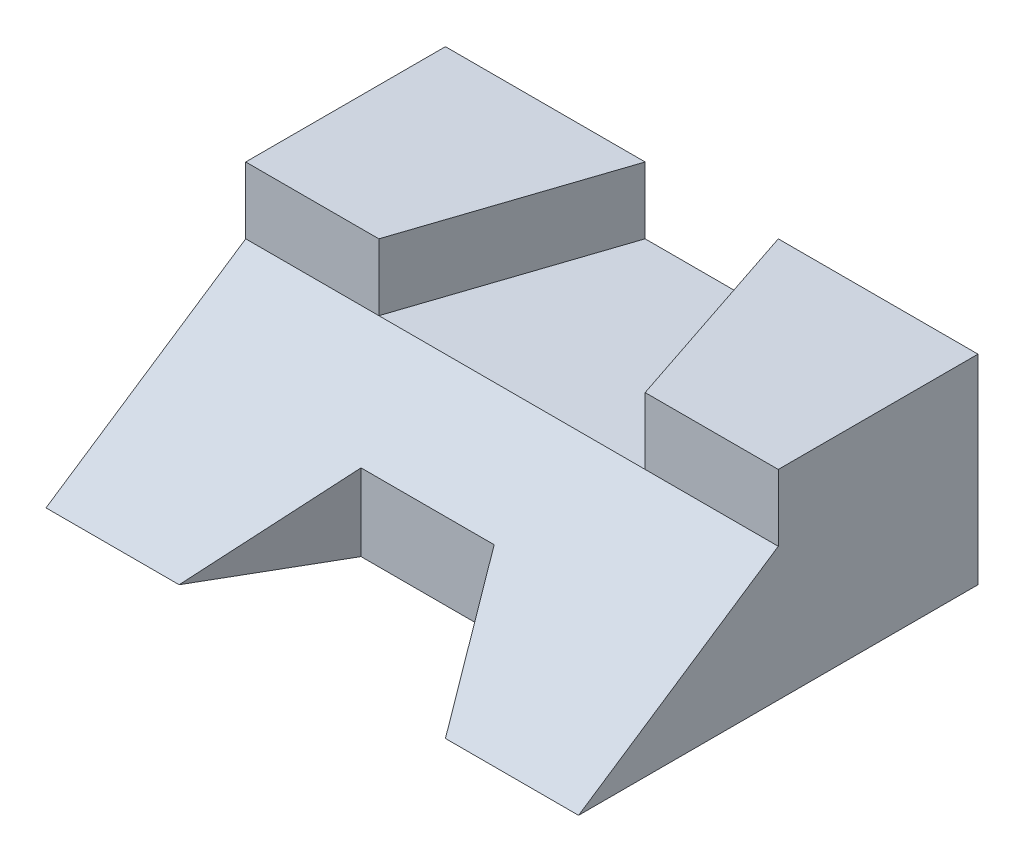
ISO-10303-21;
HEADER;
FILE_DESCRIPTION(('STEP AP214'),'2;1');
FILE_NAME('part.step','',(''),(''),'','','');
FILE_SCHEMA(('AUTOMOTIVE_DESIGN { 1 0 10303 214 1 1 1 1 }'));
ENDSEC;
DATA;
#1=APPLICATION_CONTEXT('core data for automotive mechanical design processes');
#2=APPLICATION_PROTOCOL_DEFINITION('international standard','automotive_design',2000,#1);
#3=PRODUCT_CONTEXT('',#1,'mechanical');
#4=PRODUCT('Part','Part','',(#3));
#5=PRODUCT_RELATED_PRODUCT_CATEGORY('part','',(#4));
#6=PRODUCT_DEFINITION_FORMATION('','',#4);
#7=PRODUCT_DEFINITION_CONTEXT('part definition',#1,'design');
#8=PRODUCT_DEFINITION('design','',#6,#7);
#9=PRODUCT_DEFINITION_SHAPE('','',#8);
#10=(LENGTH_UNIT() NAMED_UNIT(*) SI_UNIT(.MILLI.,.METRE.));
#11=(NAMED_UNIT(*) PLANE_ANGLE_UNIT() SI_UNIT($,.RADIAN.));
#12=(NAMED_UNIT(*) SI_UNIT($,.STERADIAN.) SOLID_ANGLE_UNIT());
#13=UNCERTAINTY_MEASURE_WITH_UNIT(LENGTH_MEASURE(1.E-05),#10,'distance_accuracy_value','');
#14=(GEOMETRIC_REPRESENTATION_CONTEXT(3) GLOBAL_UNCERTAINTY_ASSIGNED_CONTEXT((#13)) GLOBAL_UNIT_ASSIGNED_CONTEXT((#10,
#11,#12)) REPRESENTATION_CONTEXT('',''));
#15=CARTESIAN_POINT('',(0.,0.,0.));
#16=DIRECTION('',(0.,0.,1.));
#17=DIRECTION('',(1.,0.,0.));
#18=AXIS2_PLACEMENT_3D('',#15,#16,#17);
#19=CARTESIAN_POINT('',(101.6,76.2,-152.4));
#20=DIRECTION('',(0.,-1.,0.));
#21=DIRECTION('',(0.,0.,-1.));
#22=AXIS2_PLACEMENT_3D('',#19,#20,#21);
#23=PLANE('',#22);
#24=DIRECTION('',(-1.,0.,0.));
#25=VECTOR('',#24,1.);
#26=CARTESIAN_POINT('',(101.6,76.2,-152.4));
#27=LINE('',#26,#25);
#28=CARTESIAN_POINT('',(101.6,76.2,-152.4));
#29=VERTEX_POINT('',#28);
#30=CARTESIAN_POINT('',(25.4,76.2,-152.4));
#31=VERTEX_POINT('',#30);
#32=EDGE_CURVE('E173',#29,#31,#27,.T.);
#33=ORIENTED_EDGE('',*,*,#32,.T.);
#34=DIRECTION('',(-0.316227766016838,0.,-0.948683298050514));
#35=VECTOR('',#34,1.);
#36=CARTESIAN_POINT('',(50.8,76.2,-76.2));
#37=LINE('',#36,#35);
#38=CARTESIAN_POINT('',(50.8,76.2,-76.2));
#39=VERTEX_POINT('',#38);
#40=EDGE_CURVE('E136',#39,#31,#37,.T.);
#41=ORIENTED_EDGE('',*,*,#40,.F.);
#42=DIRECTION('',(-1.,0.,0.));
#43=VECTOR('',#42,1.);
#44=CARTESIAN_POINT('',(101.6,76.2,-76.2));
#45=LINE('',#44,#43);
#46=CARTESIAN_POINT('',(101.6,76.2,-76.2));
#47=VERTEX_POINT('',#46);
#48=EDGE_CURVE('E169',#47,#39,#45,.T.);
#49=ORIENTED_EDGE('',*,*,#48,.F.);
#50=DIRECTION('',(0.,0.,1.));
#51=VECTOR('',#50,1.);
#52=CARTESIAN_POINT('',(101.6,76.2,-152.4));
#53=LINE('',#52,#51);
#54=EDGE_CURVE('E162',#29,#47,#53,.T.);
#55=ORIENTED_EDGE('',*,*,#54,.F.);
#56=EDGE_LOOP('',(#33,#41,#49,#55));
#57=FACE_BOUND('',#56,.T.);
#58=ADVANCED_FACE('F29',(#57),#23,.F.);
#59=CARTESIAN_POINT('',(101.6,50.8,-76.2));
#60=DIRECTION('',(0.,0.,-1.));
#61=DIRECTION('',(-1.,0.,0.));
#62=AXIS2_PLACEMENT_3D('',#59,#60,#61);
#63=PLANE('',#62);
#64=ORIENTED_EDGE('',*,*,#48,.T.);
#65=DIRECTION('',(0.,1.,0.));
#66=VECTOR('',#65,1.);
#67=CARTESIAN_POINT('',(50.8,50.8,-76.2));
#68=LINE('',#67,#66);
#69=CARTESIAN_POINT('',(50.8,50.8,-76.2));
#70=VERTEX_POINT('',#69);
#71=EDGE_CURVE('E192',#70,#39,#68,.T.);
#72=ORIENTED_EDGE('',*,*,#71,.F.);
#73=DIRECTION('',(-1.,0.,0.));
#74=VECTOR('',#73,1.);
#75=CARTESIAN_POINT('',(101.6,50.8,-76.2));
#76=LINE('',#75,#74);
#77=CARTESIAN_POINT('',(101.6,50.8,-76.2));
#78=VERTEX_POINT('',#77);
#79=EDGE_CURVE('E166',#78,#70,#76,.T.);
#80=ORIENTED_EDGE('',*,*,#79,.F.);
#81=DIRECTION('',(0.,-1.,0.));
#82=VECTOR('',#81,1.);
#83=CARTESIAN_POINT('',(101.6,50.8,-76.2));
#84=LINE('',#83,#82);
#85=EDGE_CURVE('E151',#47,#78,#84,.T.);
#86=ORIENTED_EDGE('',*,*,#85,.F.);
#87=EDGE_LOOP('',(#64,#72,#80,#86));
#88=FACE_BOUND('',#87,.T.);
#89=ADVANCED_FACE('F244',(#88),#63,.F.);
#90=CARTESIAN_POINT('',(101.6,0.,0.));
#91=DIRECTION('',(0.,-0.832050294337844,-0.554700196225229));
#92=DIRECTION('',(0.,0.554700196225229,-0.832050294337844));
#93=AXIS2_PLACEMENT_3D('',#90,#91,#92);
#94=PLANE('',#93);
#95=DIRECTION('',(1.,0.,0.));
#96=VECTOR('',#95,1.);
#97=CARTESIAN_POINT('',(101.6,29.329393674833,-43.9940905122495));
#98=LINE('',#97,#96);
#99=CARTESIAN_POINT('',(-25.4,29.329393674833,-43.9940905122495));
#100=VERTEX_POINT('',#99);
#101=CARTESIAN_POINT('',(25.4,29.329393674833,-43.9940905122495));
#102=VERTEX_POINT('',#101);
#103=EDGE_CURVE('E135',#100,#102,#98,.T.);
#104=ORIENTED_EDGE('',*,*,#103,.T.);
#105=DIRECTION('',(0.433012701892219,-0.5,0.75));
#106=VECTOR('',#105,1.);
#107=CARTESIAN_POINT('',(60.325,-10.9985226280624,16.4977839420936));
#108=LINE('',#107,#106);
#109=CARTESIAN_POINT('',(50.8,0.,0.));
#110=VERTEX_POINT('',#109);
#111=EDGE_CURVE('E123',#102,#110,#108,.T.);
#112=ORIENTED_EDGE('',*,*,#111,.T.);
#113=DIRECTION('',(-1.,0.,0.));
#114=VECTOR('',#113,1.);
#115=CARTESIAN_POINT('',(101.6,0.,0.));
#116=LINE('',#115,#114);
#117=CARTESIAN_POINT('',(101.6,0.,0.));
#118=VERTEX_POINT('',#117);
#119=EDGE_CURVE('E11',#118,#110,#116,.T.);
#120=ORIENTED_EDGE('',*,*,#119,.F.);
#121=DIRECTION('',(0.,-0.554700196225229,0.832050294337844));
#122=VECTOR('',#121,1.);
#123=CARTESIAN_POINT('',(101.6,0.,0.));
#124=LINE('',#123,#122);
#125=EDGE_CURVE('E147',#78,#118,#124,.T.);
#126=ORIENTED_EDGE('',*,*,#125,.F.);
#127=ORIENTED_EDGE('',*,*,#79,.T.);
#128=DIRECTION('',(1.,0.,0.));
#129=VECTOR('',#128,1.);
#130=CARTESIAN_POINT('',(-50.8,50.8,-76.2));
#131=LINE('',#130,#129);
#132=CARTESIAN_POINT('',(-50.8,50.8,-76.2));
#133=VERTEX_POINT('',#132);
#134=EDGE_CURVE('E213',#133,#70,#131,.T.);
#135=ORIENTED_EDGE('',*,*,#134,.F.);
#136=CARTESIAN_POINT('',(-101.6,50.8,-76.2));
#137=VERTEX_POINT('',#136);
#138=EDGE_CURVE('E165',#133,#137,#76,.T.);
#139=ORIENTED_EDGE('',*,*,#138,.T.);
#140=DIRECTION('',(0.,-0.554700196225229,0.832050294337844));
#141=VECTOR('',#140,1.);
#142=CARTESIAN_POINT('',(-101.6,0.,0.));
#143=LINE('',#142,#141);
#144=CARTESIAN_POINT('',(-101.6,0.,0.));
#145=VERTEX_POINT('',#144);
#146=EDGE_CURVE('E186',#137,#145,#143,.T.);
#147=ORIENTED_EDGE('',*,*,#146,.T.);
#148=CARTESIAN_POINT('',(-50.8,0.,0.));
#149=VERTEX_POINT('',#148);
#150=EDGE_CURVE('E37',#149,#145,#116,.T.);
#151=ORIENTED_EDGE('',*,*,#150,.F.);
#152=DIRECTION('',(0.43301270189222,0.5,-0.75));
#153=VECTOR('',#152,1.);
#154=CARTESIAN_POINT('',(-22.225,32.9955678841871,-49.4933518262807));
#155=LINE('',#154,#153);
#156=EDGE_CURVE('E44',#149,#100,#155,.T.);
#157=ORIENTED_EDGE('',*,*,#156,.T.);
#158=EDGE_LOOP('',(#104,#112,#120,#126,#127,#135,#139,#147,#151,#157));
#159=FACE_BOUND('',#158,.T.);
#160=ADVANCED_FACE('F31',(#159),#94,.F.);
#161=CARTESIAN_POINT('',(101.6,0.,0.));
#162=DIRECTION('',(0.,1.,0.));
#163=DIRECTION('',(0.,0.,1.));
#164=AXIS2_PLACEMENT_3D('',#161,#162,#163);
#165=PLANE('',#164);
#166=ORIENTED_EDGE('',*,*,#119,.T.);
#167=DIRECTION('',(0.5,0.,0.866025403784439));
#168=VECTOR('',#167,1.);
#169=CARTESIAN_POINT('',(50.8,0.,0.));
#170=LINE('',#169,#168);
#171=CARTESIAN_POINT('',(25.4,0.,-43.9940905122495));
#172=VERTEX_POINT('',#171);
#173=EDGE_CURVE('E120',#172,#110,#170,.T.);
#174=ORIENTED_EDGE('',*,*,#173,.F.);
#175=DIRECTION('',(1.,0.,0.));
#176=VECTOR('',#175,1.);
#177=CARTESIAN_POINT('',(25.4,0.,-43.9940905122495));
#178=LINE('',#177,#176);
#179=CARTESIAN_POINT('',(-25.4,0.,-43.9940905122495));
#180=VERTEX_POINT('',#179);
#181=EDGE_CURVE('E228',#180,#172,#178,.T.);
#182=ORIENTED_EDGE('',*,*,#181,.F.);
#183=DIRECTION('',(0.5,0.,-0.866025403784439));
#184=VECTOR('',#183,1.);
#185=CARTESIAN_POINT('',(-50.8,0.,0.));
#186=LINE('',#185,#184);
#187=EDGE_CURVE('E129',#149,#180,#186,.T.);
#188=ORIENTED_EDGE('',*,*,#187,.F.);
#189=ORIENTED_EDGE('',*,*,#150,.T.);
#190=DIRECTION('',(0.,0.,-1.));
#191=VECTOR('',#190,1.);
#192=CARTESIAN_POINT('',(-101.6,0.,0.));
#193=LINE('',#192,#191);
#194=CARTESIAN_POINT('',(-101.6,0.,-152.4));
#195=VERTEX_POINT('',#194);
#196=EDGE_CURVE('E180',#145,#195,#193,.T.);
#197=ORIENTED_EDGE('',*,*,#196,.T.);
#198=DIRECTION('',(-1.,0.,0.));
#199=VECTOR('',#198,1.);
#200=CARTESIAN_POINT('',(101.6,0.,-152.4));
#201=LINE('',#200,#199);
#202=CARTESIAN_POINT('',(101.6,0.,-152.4));
#203=VERTEX_POINT('',#202);
#204=EDGE_CURVE('E143',#203,#195,#201,.T.);
#205=ORIENTED_EDGE('',*,*,#204,.F.);
#206=DIRECTION('',(0.,0.,-1.));
#207=VECTOR('',#206,1.);
#208=CARTESIAN_POINT('',(101.6,0.,0.));
#209=LINE('',#208,#207);
#210=EDGE_CURVE('E140',#118,#203,#209,.T.);
#211=ORIENTED_EDGE('',*,*,#210,.F.);
#212=EDGE_LOOP('',(#166,#174,#182,#188,#189,#197,#205,#211));
#213=FACE_BOUND('',#212,.T.);
#214=ADVANCED_FACE('F138',(#213),#165,.F.);
#215=CARTESIAN_POINT('',(101.6,0.,-152.4));
#216=DIRECTION('',(0.,0.,1.));
#217=DIRECTION('',(1.,0.,0.));
#218=AXIS2_PLACEMENT_3D('',#215,#216,#217);
#219=PLANE('',#218);
#220=DIRECTION('',(-1.,0.,0.));
#221=VECTOR('',#220,1.);
#222=CARTESIAN_POINT('',(25.4,50.8,-152.4));
#223=LINE('',#222,#221);
#224=CARTESIAN_POINT('',(25.4,50.8,-152.4));
#225=VERTEX_POINT('',#224);
#226=CARTESIAN_POINT('',(-25.4,50.8,-152.4));
#227=VERTEX_POINT('',#226);
#228=EDGE_CURVE('E216',#225,#227,#223,.T.);
#229=ORIENTED_EDGE('',*,*,#228,.F.);
#230=DIRECTION('',(0.,1.,0.));
#231=VECTOR('',#230,1.);
#232=CARTESIAN_POINT('',(25.4,50.8,-152.4));
#233=LINE('',#232,#231);
#234=EDGE_CURVE('E197',#225,#31,#233,.T.);
#235=ORIENTED_EDGE('',*,*,#234,.T.);
#236=ORIENTED_EDGE('',*,*,#32,.F.);
#237=DIRECTION('',(0.,1.,0.));
#238=VECTOR('',#237,1.);
#239=CARTESIAN_POINT('',(101.6,0.,-152.4));
#240=LINE('',#239,#238);
#241=EDGE_CURVE('E146',#203,#29,#240,.T.);
#242=ORIENTED_EDGE('',*,*,#241,.F.);
#243=ORIENTED_EDGE('',*,*,#204,.T.);
#244=DIRECTION('',(0.,1.,0.));
#245=VECTOR('',#244,1.);
#246=CARTESIAN_POINT('',(-101.6,0.,-152.4));
#247=LINE('',#246,#245);
#248=CARTESIAN_POINT('',(-101.6,76.2,-152.4));
#249=VERTEX_POINT('',#248);
#250=EDGE_CURVE('E188',#195,#249,#247,.T.);
#251=ORIENTED_EDGE('',*,*,#250,.T.);
#252=CARTESIAN_POINT('',(-25.4,76.2,-152.4));
#253=VERTEX_POINT('',#252);
#254=EDGE_CURVE('E172',#253,#249,#27,.T.);
#255=ORIENTED_EDGE('',*,*,#254,.F.);
#256=DIRECTION('',(0.,1.,0.));
#257=VECTOR('',#256,1.);
#258=CARTESIAN_POINT('',(-25.4,50.8,-152.4));
#259=LINE('',#258,#257);
#260=EDGE_CURVE('E210',#227,#253,#259,.T.);
#261=ORIENTED_EDGE('',*,*,#260,.F.);
#262=EDGE_LOOP('',(#229,#235,#236,#242,#243,#251,#255,#261));
#263=FACE_BOUND('',#262,.T.);
#264=ADVANCED_FACE('F255',(#263),#219,.F.);
#265=CARTESIAN_POINT('',(-50.8,76.2,-76.2));
#266=VERTEX_POINT('',#265);
#267=CARTESIAN_POINT('',(-101.6,76.2,-76.2));
#268=VERTEX_POINT('',#267);
#269=EDGE_CURVE('E168',#266,#268,#45,.T.);
#270=ORIENTED_EDGE('',*,*,#269,.F.);
#271=DIRECTION('',(-0.316227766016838,0.,0.948683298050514));
#272=VECTOR('',#271,1.);
#273=CARTESIAN_POINT('',(-50.8,76.2,-76.2));
#274=LINE('',#273,#272);
#275=EDGE_CURVE('E221',#253,#266,#274,.T.);
#276=ORIENTED_EDGE('',*,*,#275,.F.);
#277=ORIENTED_EDGE('',*,*,#254,.T.);
#278=DIRECTION('',(0.,0.,1.));
#279=VECTOR('',#278,1.);
#280=CARTESIAN_POINT('',(-101.6,76.2,-152.4));
#281=LINE('',#280,#279);
#282=EDGE_CURVE('E157',#249,#268,#281,.T.);
#283=ORIENTED_EDGE('',*,*,#282,.T.);
#284=EDGE_LOOP('',(#270,#276,#277,#283));
#285=FACE_BOUND('',#284,.T.);
#286=ADVANCED_FACE('F203',(#285),#23,.F.);
#287=ORIENTED_EDGE('',*,*,#138,.F.);
#288=DIRECTION('',(0.,1.,0.));
#289=VECTOR('',#288,1.);
#290=CARTESIAN_POINT('',(-50.8,50.8,-76.2));
#291=LINE('',#290,#289);
#292=EDGE_CURVE('E194',#133,#266,#291,.T.);
#293=ORIENTED_EDGE('',*,*,#292,.T.);
#294=ORIENTED_EDGE('',*,*,#269,.T.);
#295=DIRECTION('',(0.,-1.,0.));
#296=VECTOR('',#295,1.);
#297=CARTESIAN_POINT('',(-101.6,50.8,-76.2));
#298=LINE('',#297,#296);
#299=EDGE_CURVE('E154',#268,#137,#298,.T.);
#300=ORIENTED_EDGE('',*,*,#299,.T.);
#301=EDGE_LOOP('',(#287,#293,#294,#300));
#302=FACE_BOUND('',#301,.T.);
#303=ADVANCED_FACE('F207',(#302),#63,.F.);
#304=CARTESIAN_POINT('',(101.6,101.6,-152.4));
#305=DIRECTION('',(1.,0.,0.));
#306=DIRECTION('',(0.,0.,-1.));
#307=AXIS2_PLACEMENT_3D('',#304,#305,#306);
#308=PLANE('',#307);
#309=ORIENTED_EDGE('',*,*,#125,.T.);
#310=ORIENTED_EDGE('',*,*,#210,.T.);
#311=ORIENTED_EDGE('',*,*,#241,.T.);
#312=ORIENTED_EDGE('',*,*,#54,.T.);
#313=ORIENTED_EDGE('',*,*,#85,.T.);
#314=EDGE_LOOP('',(#309,#310,#311,#312,#313));
#315=FACE_BOUND('',#314,.T.);
#316=ADVANCED_FACE('F149',(#315),#308,.T.);
#317=CARTESIAN_POINT('',(-101.6,101.6,-152.4));
#318=DIRECTION('',(1.,0.,0.));
#319=DIRECTION('',(0.,0.,-1.));
#320=AXIS2_PLACEMENT_3D('',#317,#318,#319);
#321=PLANE('',#320);
#322=ORIENTED_EDGE('',*,*,#146,.F.);
#323=ORIENTED_EDGE('',*,*,#299,.F.);
#324=ORIENTED_EDGE('',*,*,#282,.F.);
#325=ORIENTED_EDGE('',*,*,#250,.F.);
#326=ORIENTED_EDGE('',*,*,#196,.F.);
#327=EDGE_LOOP('',(#322,#323,#324,#325,#326));
#328=FACE_BOUND('',#327,.T.);
#329=ADVANCED_FACE('F184',(#328),#321,.F.);
#330=CARTESIAN_POINT('',(50.8,50.8,-76.2));
#331=DIRECTION('',(0.948683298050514,0.,-0.316227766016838));
#332=DIRECTION('',(-0.316227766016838,0.,-0.948683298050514));
#333=AXIS2_PLACEMENT_3D('',#330,#331,#332);
#334=PLANE('',#333);
#335=ORIENTED_EDGE('',*,*,#40,.T.);
#336=ORIENTED_EDGE('',*,*,#234,.F.);
#337=DIRECTION('',(-0.316227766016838,0.,-0.948683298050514));
#338=VECTOR('',#337,1.);
#339=CARTESIAN_POINT('',(50.8,50.8,-76.2));
#340=LINE('',#339,#338);
#341=EDGE_CURVE('E218',#70,#225,#340,.T.);
#342=ORIENTED_EDGE('',*,*,#341,.F.);
#343=ORIENTED_EDGE('',*,*,#71,.T.);
#344=EDGE_LOOP('',(#335,#336,#342,#343));
#345=FACE_BOUND('',#344,.T.);
#346=ADVANCED_FACE('F269',(#345),#334,.F.);
#347=CARTESIAN_POINT('',(-50.8,50.8,-76.2));
#348=DIRECTION('',(-0.948683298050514,0.,-0.316227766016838));
#349=DIRECTION('',(-0.316227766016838,0.,0.948683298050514));
#350=AXIS2_PLACEMENT_3D('',#347,#348,#349);
#351=PLANE('',#350);
#352=ORIENTED_EDGE('',*,*,#275,.T.);
#353=ORIENTED_EDGE('',*,*,#292,.F.);
#354=DIRECTION('',(-0.316227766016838,0.,0.948683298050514));
#355=VECTOR('',#354,1.);
#356=CARTESIAN_POINT('',(-50.8,50.8,-76.2));
#357=LINE('',#356,#355);
#358=EDGE_CURVE('E52',#227,#133,#357,.T.);
#359=ORIENTED_EDGE('',*,*,#358,.F.);
#360=ORIENTED_EDGE('',*,*,#260,.T.);
#361=EDGE_LOOP('',(#352,#353,#359,#360));
#362=FACE_BOUND('',#361,.T.);
#363=ADVANCED_FACE('F274',(#362),#351,.F.);
#364=CARTESIAN_POINT('',(50.8,50.8,-76.2));
#365=DIRECTION('',(0.,-1.,0.));
#366=DIRECTION('',(0.,0.,-1.));
#367=AXIS2_PLACEMENT_3D('',#364,#365,#366);
#368=PLANE('',#367);
#369=ORIENTED_EDGE('',*,*,#341,.T.);
#370=ORIENTED_EDGE('',*,*,#228,.T.);
#371=ORIENTED_EDGE('',*,*,#358,.T.);
#372=ORIENTED_EDGE('',*,*,#134,.T.);
#373=EDGE_LOOP('',(#369,#370,#371,#372));
#374=FACE_BOUND('',#373,.T.);
#375=ADVANCED_FACE('F241',(#374),#368,.F.);
#376=CARTESIAN_POINT('',(50.8,76.2,0.));
#377=DIRECTION('',(0.866025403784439,0.,-0.5));
#378=DIRECTION('',(-0.5,0.,-0.866025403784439));
#379=AXIS2_PLACEMENT_3D('',#376,#377,#378);
#380=PLANE('',#379);
#381=DIRECTION('',(0.,-1.,0.));
#382=VECTOR('',#381,1.);
#383=CARTESIAN_POINT('',(25.4,76.2,-43.9940905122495));
#384=LINE('',#383,#382);
#385=EDGE_CURVE('E125',#102,#172,#384,.T.);
#386=ORIENTED_EDGE('',*,*,#385,.T.);
#387=ORIENTED_EDGE('',*,*,#173,.T.);
#388=ORIENTED_EDGE('',*,*,#111,.F.);
#389=EDGE_LOOP('',(#386,#387,#388));
#390=FACE_BOUND('',#389,.T.);
#391=ADVANCED_FACE('F122',(#390),#380,.F.);
#392=CARTESIAN_POINT('',(25.4,76.2,-43.9940905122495));
#393=DIRECTION('',(0.,0.,-1.));
#394=DIRECTION('',(-1.,0.,0.));
#395=AXIS2_PLACEMENT_3D('',#392,#393,#394);
#396=PLANE('',#395);
#397=DIRECTION('',(0.,-1.,0.));
#398=VECTOR('',#397,1.);
#399=CARTESIAN_POINT('',(-25.4,76.2,-43.9940905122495));
#400=LINE('',#399,#398);
#401=EDGE_CURVE('E226',#100,#180,#400,.T.);
#402=ORIENTED_EDGE('',*,*,#401,.T.);
#403=ORIENTED_EDGE('',*,*,#181,.T.);
#404=ORIENTED_EDGE('',*,*,#385,.F.);
#405=ORIENTED_EDGE('',*,*,#103,.F.);
#406=EDGE_LOOP('',(#402,#403,#404,#405));
#407=FACE_BOUND('',#406,.T.);
#408=ADVANCED_FACE('F233',(#407),#396,.F.);
#409=CARTESIAN_POINT('',(-50.8,76.2,0.));
#410=DIRECTION('',(-0.866025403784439,0.,-0.5));
#411=DIRECTION('',(-0.5,0.,0.866025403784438));
#412=AXIS2_PLACEMENT_3D('',#409,#410,#411);
#413=PLANE('',#412);
#414=ORIENTED_EDGE('',*,*,#187,.T.);
#415=ORIENTED_EDGE('',*,*,#401,.F.);
#416=ORIENTED_EDGE('',*,*,#156,.F.);
#417=EDGE_LOOP('',(#414,#415,#416));
#418=FACE_BOUND('',#417,.T.);
#419=ADVANCED_FACE('F231',(#418),#413,.F.);
#420=CLOSED_SHELL('',(#58,#89,#160,#214,#264,#286,#303,#316,#329,#346,#363,#375,#391,#408,#419));
#421=MANIFOLD_SOLID_BREP('B2',#420);
#422=ADVANCED_BREP_SHAPE_REPRESENTATION('',(#18,#421),#14);
#423=SHAPE_DEFINITION_REPRESENTATION(#9,#422);
ENDSEC;
END-ISO-10303-21;
